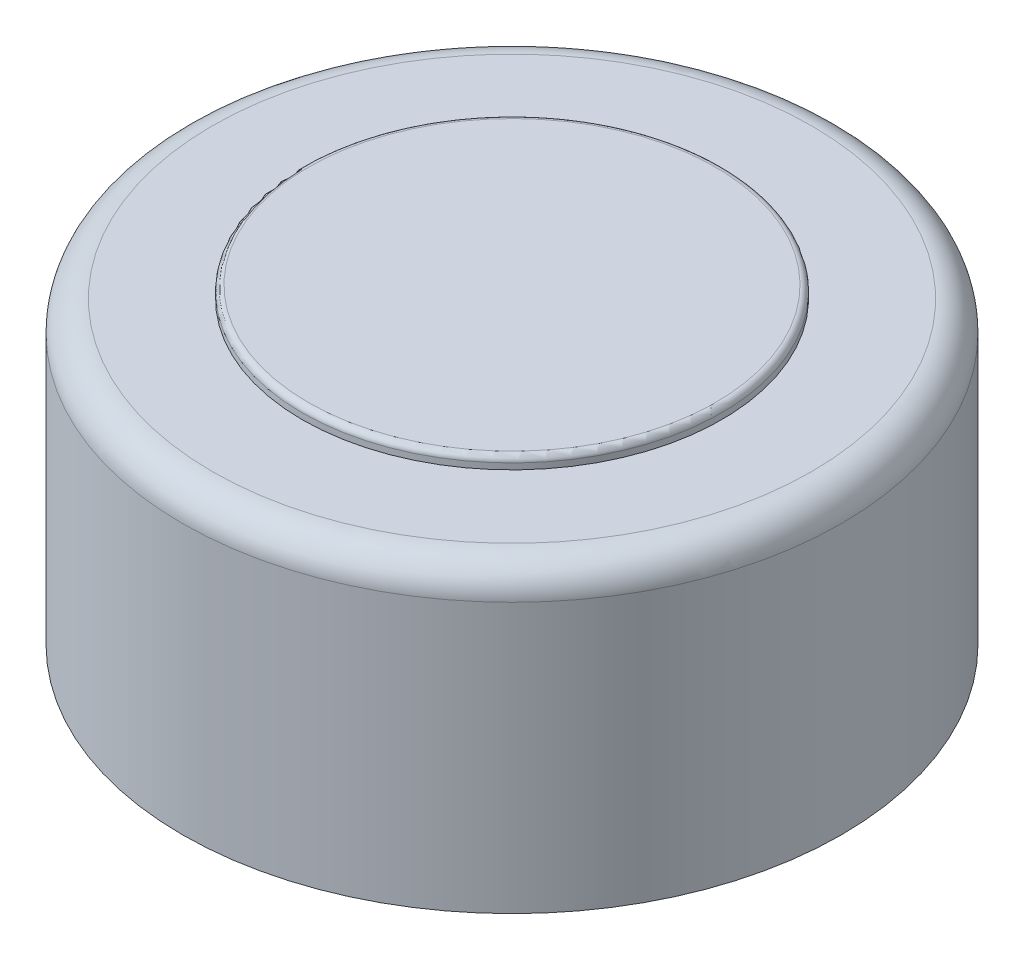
ISO-10303-21;
HEADER;
FILE_DESCRIPTION(('STEP AP214'),'2;1');
FILE_NAME('part.step','',(''),(''),'','','');
FILE_SCHEMA(('AUTOMOTIVE_DESIGN { 1 0 10303 214 1 1 1 1 }'));
ENDSEC;
DATA;
#1=APPLICATION_CONTEXT('core data for automotive mechanical design processes');
#2=APPLICATION_PROTOCOL_DEFINITION('international standard','automotive_design',2000,#1);
#3=PRODUCT_CONTEXT('',#1,'mechanical');
#4=PRODUCT('Part','Part','',(#3));
#5=PRODUCT_RELATED_PRODUCT_CATEGORY('part','',(#4));
#6=PRODUCT_DEFINITION_FORMATION('','',#4);
#7=PRODUCT_DEFINITION_CONTEXT('part definition',#1,'design');
#8=PRODUCT_DEFINITION('design','',#6,#7);
#9=PRODUCT_DEFINITION_SHAPE('','',#8);
#10=(LENGTH_UNIT() NAMED_UNIT(*) SI_UNIT(.MILLI.,.METRE.));
#11=(NAMED_UNIT(*) PLANE_ANGLE_UNIT() SI_UNIT($,.RADIAN.));
#12=(NAMED_UNIT(*) SI_UNIT($,.STERADIAN.) SOLID_ANGLE_UNIT());
#13=UNCERTAINTY_MEASURE_WITH_UNIT(LENGTH_MEASURE(1.E-05),#10,'distance_accuracy_value','');
#14=(GEOMETRIC_REPRESENTATION_CONTEXT(3) GLOBAL_UNCERTAINTY_ASSIGNED_CONTEXT((#13)) GLOBAL_UNIT_ASSIGNED_CONTEXT((#10,
#11,#12)) REPRESENTATION_CONTEXT('',''));
#15=CARTESIAN_POINT('',(0.,0.,0.));
#16=DIRECTION('',(0.,0.,1.));
#17=DIRECTION('',(1.,0.,0.));
#18=AXIS2_PLACEMENT_3D('',#15,#16,#17);
#19=CARTESIAN_POINT('',(0.,0.,0.));
#20=DIRECTION('',(0.,1.,0.));
#21=DIRECTION('',(0.,0.,1.));
#22=AXIS2_PLACEMENT_3D('',#19,#20,#21);
#23=PLANE('',#22);
#24=CARTESIAN_POINT('',(0.,0.,0.));
#25=DIRECTION('',(0.,1.,0.));
#26=DIRECTION('',(0.,0.,1.));
#27=AXIS2_PLACEMENT_3D('',#24,#25,#26);
#28=CIRCLE('',#27,5.5);
#29=CARTESIAN_POINT('',(0.,0.,5.5));
#30=VERTEX_POINT('',#29);
#31=EDGE_CURVE('E10',#30,#30,#28,.T.);
#32=ORIENTED_EDGE('',*,*,#31,.F.);
#33=EDGE_LOOP('',(#32));
#34=FACE_BOUND('',#33,.T.);
#35=ADVANCED_FACE('F31',(#34),#23,.F.);
#36=CARTESIAN_POINT('',(0.,23.0534003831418,0.));
#37=DIRECTION('',(0.,1.,0.));
#38=DIRECTION('',(0.,0.,1.));
#39=AXIS2_PLACEMENT_3D('',#36,#37,#38);
#40=CYLINDRICAL_SURFACE('',#39,5.5);
#41=CARTESIAN_POINT('',(0.,4.5,0.));
#42=DIRECTION('',(0.,1.,0.));
#43=DIRECTION('',(0.,0.,1.));
#44=AXIS2_PLACEMENT_3D('',#41,#42,#43);
#45=CIRCLE('',#44,5.5);
#46=CARTESIAN_POINT('',(0.,4.5,5.5));
#47=VERTEX_POINT('',#46);
#48=EDGE_CURVE('E37',#47,#47,#45,.T.);
#49=ORIENTED_EDGE('',*,*,#48,.F.);
#50=EDGE_LOOP('',(#49));
#51=FACE_BOUND('',#50,.T.);
#52=ORIENTED_EDGE('',*,*,#31,.T.);
#53=EDGE_LOOP('',(#52));
#54=FACE_BOUND('',#53,.T.);
#55=ADVANCED_FACE('F79',(#51,#54),#40,.T.);
#56=CARTESIAN_POINT('',(0.,4.5,0.));
#57=DIRECTION('',(0.,1.,0.));
#58=DIRECTION('',(0.,0.,1.));
#59=AXIS2_PLACEMENT_3D('',#56,#57,#58);
#60=TOROIDAL_SURFACE('',#59,5.,0.5);
#61=CARTESIAN_POINT('',(0.,5.,0.));
#62=DIRECTION('',(0.,1.,0.));
#63=DIRECTION('',(0.,0.,1.));
#64=AXIS2_PLACEMENT_3D('',#61,#62,#63);
#65=CIRCLE('',#64,5.);
#66=CARTESIAN_POINT('',(0.,5.,5.));
#67=VERTEX_POINT('',#66);
#68=EDGE_CURVE('E41',#67,#67,#65,.T.);
#69=ORIENTED_EDGE('',*,*,#68,.F.);
#70=EDGE_LOOP('',(#69));
#71=FACE_BOUND('',#70,.T.);
#72=ORIENTED_EDGE('',*,*,#48,.T.);
#73=EDGE_LOOP('',(#72));
#74=FACE_BOUND('',#73,.T.);
#75=ADVANCED_FACE('F74',(#71,#74),#60,.T.);
#76=CARTESIAN_POINT('',(0.,5.,-5.));
#77=DIRECTION('',(0.,-1.,0.));
#78=DIRECTION('',(0.,0.,-1.));
#79=AXIS2_PLACEMENT_3D('',#76,#77,#78);
#80=PLANE('',#79);
#81=CARTESIAN_POINT('',(0.,5.,0.));
#82=DIRECTION('',(0.,1.,0.));
#83=DIRECTION('',(0.,0.,1.));
#84=AXIS2_PLACEMENT_3D('',#81,#82,#83);
#85=CIRCLE('',#84,3.5);
#86=CARTESIAN_POINT('',(0.,5.,3.5));
#87=VERTEX_POINT('',#86);
#88=EDGE_CURVE('E45',#87,#87,#85,.T.);
#89=ORIENTED_EDGE('',*,*,#88,.F.);
#90=EDGE_LOOP('',(#89));
#91=FACE_BOUND('',#90,.T.);
#92=ORIENTED_EDGE('',*,*,#68,.T.);
#93=EDGE_LOOP('',(#92));
#94=FACE_BOUND('',#93,.T.);
#95=ADVANCED_FACE('F68',(#91,#94),#80,.F.);
#96=CARTESIAN_POINT('',(0.,23.0534003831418,0.));
#97=DIRECTION('',(0.,1.,0.));
#98=DIRECTION('',(0.,0.,1.));
#99=AXIS2_PLACEMENT_3D('',#96,#97,#98);
#100=CYLINDRICAL_SURFACE('',#99,3.5);
#101=CARTESIAN_POINT('',(0.,5.1,0.));
#102=DIRECTION('',(0.,1.,0.));
#103=DIRECTION('',(0.,0.,1.));
#104=AXIS2_PLACEMENT_3D('',#101,#102,#103);
#105=CIRCLE('',#104,3.5);
#106=CARTESIAN_POINT('',(0.,5.1,3.5));
#107=VERTEX_POINT('',#106);
#108=EDGE_CURVE('E50',#107,#107,#105,.T.);
#109=ORIENTED_EDGE('',*,*,#108,.F.);
#110=EDGE_LOOP('',(#109));
#111=FACE_BOUND('',#110,.T.);
#112=ORIENTED_EDGE('',*,*,#88,.T.);
#113=EDGE_LOOP('',(#112));
#114=FACE_BOUND('',#113,.T.);
#115=ADVANCED_FACE('F62',(#111,#114),#100,.T.);
#116=CARTESIAN_POINT('',(0.,5.1,0.));
#117=DIRECTION('',(0.,1.,0.));
#118=DIRECTION('',(0.,0.,1.));
#119=AXIS2_PLACEMENT_3D('',#116,#117,#118);
#120=TOROIDAL_SURFACE('',#119,3.4,0.1);
#121=CARTESIAN_POINT('',(0.,5.2,0.));
#122=DIRECTION('',(0.,1.,0.));
#123=DIRECTION('',(0.,0.,1.));
#124=AXIS2_PLACEMENT_3D('',#121,#122,#123);
#125=CIRCLE('',#124,3.4);
#126=CARTESIAN_POINT('',(0.,5.2,3.4));
#127=VERTEX_POINT('',#126);
#128=EDGE_CURVE('E53',#127,#127,#125,.T.);
#129=ORIENTED_EDGE('',*,*,#128,.F.);
#130=EDGE_LOOP('',(#129));
#131=FACE_BOUND('',#130,.T.);
#132=ORIENTED_EDGE('',*,*,#108,.T.);
#133=EDGE_LOOP('',(#132));
#134=FACE_BOUND('',#133,.T.);
#135=ADVANCED_FACE('F59',(#131,#134),#120,.T.);
#136=CARTESIAN_POINT('',(0.,5.2,-3.4));
#137=DIRECTION('',(0.,-1.,0.));
#138=DIRECTION('',(0.,0.,-1.));
#139=AXIS2_PLACEMENT_3D('',#136,#137,#138);
#140=PLANE('',#139);
#141=ORIENTED_EDGE('',*,*,#128,.T.);
#142=EDGE_LOOP('',(#141));
#143=FACE_BOUND('',#142,.T.);
#144=ADVANCED_FACE('F57',(#143),#140,.F.);
#145=CLOSED_SHELL('',(#35,#55,#75,#95,#115,#135,#144));
#146=MANIFOLD_SOLID_BREP('B2',#145);
#147=ADVANCED_BREP_SHAPE_REPRESENTATION('',(#18,#146),#14);
#148=SHAPE_DEFINITION_REPRESENTATION(#9,#147);
ENDSEC;
END-ISO-10303-21;
